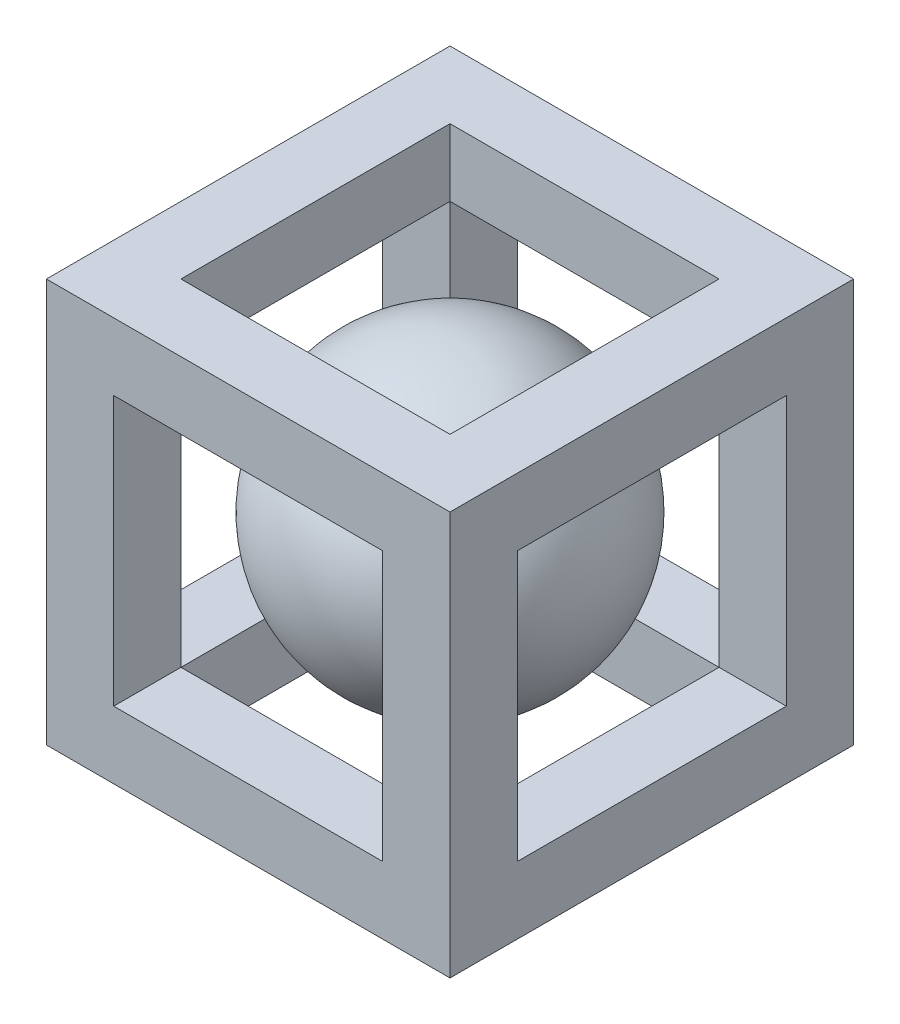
ISO-10303-21;
HEADER;
FILE_DESCRIPTION(('STEP AP214'),'2;1');
FILE_NAME('part.step','',(''),(''),'','','');
FILE_SCHEMA(('AUTOMOTIVE_DESIGN { 1 0 10303 214 1 1 1 1 }'));
ENDSEC;
DATA;
#1=APPLICATION_CONTEXT('core data for automotive mechanical design processes');
#2=APPLICATION_PROTOCOL_DEFINITION('international standard','automotive_design',2000,#1);
#3=PRODUCT_CONTEXT('',#1,'mechanical');
#4=PRODUCT('Part','Part','',(#3));
#5=PRODUCT_RELATED_PRODUCT_CATEGORY('part','',(#4));
#6=PRODUCT_DEFINITION_FORMATION('','',#4);
#7=PRODUCT_DEFINITION_CONTEXT('part definition',#1,'design');
#8=PRODUCT_DEFINITION('design','',#6,#7);
#9=PRODUCT_DEFINITION_SHAPE('','',#8);
#10=(LENGTH_UNIT() NAMED_UNIT(*) SI_UNIT(.MILLI.,.METRE.));
#11=(NAMED_UNIT(*) PLANE_ANGLE_UNIT() SI_UNIT($,.RADIAN.));
#12=(NAMED_UNIT(*) SI_UNIT($,.STERADIAN.) SOLID_ANGLE_UNIT());
#13=UNCERTAINTY_MEASURE_WITH_UNIT(LENGTH_MEASURE(1.E-05),#10,'distance_accuracy_value','');
#14=(GEOMETRIC_REPRESENTATION_CONTEXT(3) GLOBAL_UNCERTAINTY_ASSIGNED_CONTEXT((#13)) GLOBAL_UNIT_ASSIGNED_CONTEXT((#10,
#11,#12)) REPRESENTATION_CONTEXT('',''));
#15=CARTESIAN_POINT('',(0.,0.,0.));
#16=DIRECTION('',(0.,0.,1.));
#17=DIRECTION('',(1.,0.,0.));
#18=AXIS2_PLACEMENT_3D('',#15,#16,#17);
#19=CARTESIAN_POINT('',(-30.,30.,30.));
#20=DIRECTION('',(0.,1.,0.));
#21=DIRECTION('',(0.,0.,1.));
#22=AXIS2_PLACEMENT_3D('',#19,#20,#21);
#23=SPHERICAL_SURFACE('',#22,22.5);
#24=CARTESIAN_POINT('',(-30.,52.5,30.));
#25=VERTEX_POINT('',#24);
#26=VERTEX_LOOP('',#25);
#27=FACE_BOUND('',#26,.T.);
#28=ADVANCED_FACE('F49',(#27),#23,.T.);
#29=CLOSED_SHELL('',(#28));
#30=MANIFOLD_SOLID_BREP('B2',#29);
#31=CARTESIAN_POINT('',(0.,0.,60.));
#32=DIRECTION('',(-1.,0.,0.));
#33=DIRECTION('',(0.,0.,1.));
#34=AXIS2_PLACEMENT_3D('',#31,#32,#33);
#35=PLANE('',#34);
#36=DIRECTION('',(0.,1.,0.));
#37=VECTOR('',#36,1.);
#38=CARTESIAN_POINT('',(0.,0.,0.));
#39=LINE('',#38,#37);
#40=CARTESIAN_POINT('',(0.,0.,0.));
#41=VERTEX_POINT('',#40);
#42=CARTESIAN_POINT('',(0.,60.,0.));
#43=VERTEX_POINT('',#42);
#44=EDGE_CURVE('E341',#41,#43,#39,.T.);
#45=ORIENTED_EDGE('',*,*,#44,.T.);
#46=DIRECTION('',(0.,0.,-1.));
#47=VECTOR('',#46,1.);
#48=CARTESIAN_POINT('',(0.,60.,60.));
#49=LINE('',#48,#47);
#50=CARTESIAN_POINT('',(0.,60.,60.));
#51=VERTEX_POINT('',#50);
#52=EDGE_CURVE('E368',#51,#43,#49,.T.);
#53=ORIENTED_EDGE('',*,*,#52,.F.);
#54=DIRECTION('',(0.,1.,0.));
#55=VECTOR('',#54,1.);
#56=CARTESIAN_POINT('',(0.,0.,60.));
#57=LINE('',#56,#55);
#58=CARTESIAN_POINT('',(0.,0.,60.));
#59=VERTEX_POINT('',#58);
#60=EDGE_CURVE('E342',#59,#51,#57,.T.);
#61=ORIENTED_EDGE('',*,*,#60,.F.);
#62=DIRECTION('',(0.,0.,-1.));
#63=VECTOR('',#62,1.);
#64=CARTESIAN_POINT('',(0.,0.,60.));
#65=LINE('',#64,#63);
#66=EDGE_CURVE('E352',#59,#41,#65,.T.);
#67=ORIENTED_EDGE('',*,*,#66,.T.);
#68=EDGE_LOOP('',(#45,#53,#61,#67));
#69=FACE_BOUND('',#68,.T.);
#70=DIRECTION('',(0.,-1.,0.));
#71=VECTOR('',#70,1.);
#72=CARTESIAN_POINT('',(0.,0.,50.));
#73=LINE('',#72,#71);
#74=CARTESIAN_POINT('',(0.,50.,50.));
#75=VERTEX_POINT('',#74);
#76=CARTESIAN_POINT('',(0.,10.,50.));
#77=VERTEX_POINT('',#76);
#78=EDGE_CURVE('E257',#75,#77,#73,.T.);
#79=ORIENTED_EDGE('',*,*,#78,.F.);
#80=DIRECTION('',(0.,0.,1.));
#81=VECTOR('',#80,1.);
#82=CARTESIAN_POINT('',(0.,50.,60.));
#83=LINE('',#82,#81);
#84=CARTESIAN_POINT('',(0.,50.,10.));
#85=VERTEX_POINT('',#84);
#86=EDGE_CURVE('E237',#85,#75,#83,.T.);
#87=ORIENTED_EDGE('',*,*,#86,.F.);
#88=DIRECTION('',(0.,1.,0.));
#89=VECTOR('',#88,1.);
#90=CARTESIAN_POINT('',(0.,0.,9.99999999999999));
#91=LINE('',#90,#89);
#92=CARTESIAN_POINT('',(0.,10.,9.99999999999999));
#93=VERTEX_POINT('',#92);
#94=EDGE_CURVE('E252',#93,#85,#91,.T.);
#95=ORIENTED_EDGE('',*,*,#94,.F.);
#96=DIRECTION('',(0.,0.,-1.));
#97=VECTOR('',#96,1.);
#98=CARTESIAN_POINT('',(0.,10.,60.));
#99=LINE('',#98,#97);
#100=EDGE_CURVE('E244',#77,#93,#99,.T.);
#101=ORIENTED_EDGE('',*,*,#100,.F.);
#102=EDGE_LOOP('',(#79,#87,#95,#101));
#103=FACE_BOUND('',#102,.T.);
#104=ADVANCED_FACE('F64',(#69,#103),#35,.F.);
#105=CARTESIAN_POINT('',(-60.,0.,60.));
#106=DIRECTION('',(1.,0.,0.));
#107=DIRECTION('',(0.,0.,-1.));
#108=AXIS2_PLACEMENT_3D('',#105,#106,#107);
#109=PLANE('',#108);
#110=DIRECTION('',(0.,-1.,0.));
#111=VECTOR('',#110,1.);
#112=CARTESIAN_POINT('',(-60.,0.,0.));
#113=LINE('',#112,#111);
#114=CARTESIAN_POINT('',(-60.,60.,0.));
#115=VERTEX_POINT('',#114);
#116=CARTESIAN_POINT('',(-60.,0.,0.));
#117=VERTEX_POINT('',#116);
#118=EDGE_CURVE('E357',#115,#117,#113,.T.);
#119=ORIENTED_EDGE('',*,*,#118,.T.);
#120=DIRECTION('',(0.,0.,-1.));
#121=VECTOR('',#120,1.);
#122=CARTESIAN_POINT('',(-60.,0.,60.));
#123=LINE('',#122,#121);
#124=CARTESIAN_POINT('',(-60.,0.,60.));
#125=VERTEX_POINT('',#124);
#126=EDGE_CURVE('E362',#125,#117,#123,.T.);
#127=ORIENTED_EDGE('',*,*,#126,.F.);
#128=DIRECTION('',(0.,-1.,0.));
#129=VECTOR('',#128,1.);
#130=CARTESIAN_POINT('',(-60.,0.,60.));
#131=LINE('',#130,#129);
#132=CARTESIAN_POINT('',(-60.,60.,60.));
#133=VERTEX_POINT('',#132);
#134=EDGE_CURVE('E348',#133,#125,#131,.T.);
#135=ORIENTED_EDGE('',*,*,#134,.F.);
#136=DIRECTION('',(0.,0.,-1.));
#137=VECTOR('',#136,1.);
#138=CARTESIAN_POINT('',(-60.,60.,60.));
#139=LINE('',#138,#137);
#140=EDGE_CURVE('E365',#133,#115,#139,.T.);
#141=ORIENTED_EDGE('',*,*,#140,.T.);
#142=EDGE_LOOP('',(#119,#127,#135,#141));
#143=FACE_BOUND('',#142,.T.);
#144=DIRECTION('',(0.,-1.,0.));
#145=VECTOR('',#144,1.);
#146=CARTESIAN_POINT('',(-60.,50.,50.));
#147=LINE('',#146,#145);
#148=CARTESIAN_POINT('',(-60.,50.,50.));
#149=VERTEX_POINT('',#148);
#150=CARTESIAN_POINT('',(-60.,10.,50.));
#151=VERTEX_POINT('',#150);
#152=EDGE_CURVE('E86',#149,#151,#147,.T.);
#153=ORIENTED_EDGE('',*,*,#152,.T.);
#154=DIRECTION('',(0.,0.,-1.));
#155=VECTOR('',#154,1.);
#156=CARTESIAN_POINT('',(-60.,10.,50.));
#157=LINE('',#156,#155);
#158=CARTESIAN_POINT('',(-60.,10.,9.99999999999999));
#159=VERTEX_POINT('',#158);
#160=EDGE_CURVE('E208',#151,#159,#157,.T.);
#161=ORIENTED_EDGE('',*,*,#160,.T.);
#162=DIRECTION('',(0.,1.,0.));
#163=VECTOR('',#162,1.);
#164=CARTESIAN_POINT('',(-60.,50.,10.));
#165=LINE('',#164,#163);
#166=CARTESIAN_POINT('',(-60.,50.,10.));
#167=VERTEX_POINT('',#166);
#168=EDGE_CURVE('E215',#159,#167,#165,.T.);
#169=ORIENTED_EDGE('',*,*,#168,.T.);
#170=DIRECTION('',(0.,0.,1.));
#171=VECTOR('',#170,1.);
#172=CARTESIAN_POINT('',(-60.,50.,50.));
#173=LINE('',#172,#171);
#174=EDGE_CURVE('E220',#167,#149,#173,.T.);
#175=ORIENTED_EDGE('',*,*,#174,.T.);
#176=EDGE_LOOP('',(#153,#161,#169,#175));
#177=FACE_BOUND('',#176,.T.);
#178=ADVANCED_FACE('F218',(#143,#177),#109,.F.);
#179=CARTESIAN_POINT('',(-10.,10.,60.));
#180=DIRECTION('',(-1.,0.,0.));
#181=DIRECTION('',(0.,-1.,0.));
#182=AXIS2_PLACEMENT_3D('',#179,#180,#181);
#183=PLANE('',#182);
#184=DIRECTION('',(0.,0.,-1.));
#185=VECTOR('',#184,1.);
#186=CARTESIAN_POINT('',(-10.,50.,60.));
#187=LINE('',#186,#185);
#188=CARTESIAN_POINT('',(-10.,50.,60.));
#189=VERTEX_POINT('',#188);
#190=CARTESIAN_POINT('',(-10.,50.,50.));
#191=VERTEX_POINT('',#190);
#192=EDGE_CURVE('E338',#189,#191,#187,.T.);
#193=ORIENTED_EDGE('',*,*,#192,.T.);
#194=DIRECTION('',(0.,-1.,0.));
#195=VECTOR('',#194,1.);
#196=CARTESIAN_POINT('',(-10.,10.,50.));
#197=LINE('',#196,#195);
#198=CARTESIAN_POINT('',(-10.,10.,50.));
#199=VERTEX_POINT('',#198);
#200=EDGE_CURVE('E254',#191,#199,#197,.T.);
#201=ORIENTED_EDGE('',*,*,#200,.T.);
#202=DIRECTION('',(0.,0.,-1.));
#203=VECTOR('',#202,1.);
#204=CARTESIAN_POINT('',(-10.,10.,60.));
#205=LINE('',#204,#203);
#206=CARTESIAN_POINT('',(-10.,10.,60.));
#207=VERTEX_POINT('',#206);
#208=EDGE_CURVE('E326',#207,#199,#205,.T.);
#209=ORIENTED_EDGE('',*,*,#208,.F.);
#210=DIRECTION('',(0.,1.,0.));
#211=VECTOR('',#210,1.);
#212=CARTESIAN_POINT('',(-10.,10.,60.));
#213=LINE('',#212,#211);
#214=EDGE_CURVE('E305',#207,#189,#213,.T.);
#215=ORIENTED_EDGE('',*,*,#214,.T.);
#216=EDGE_LOOP('',(#193,#201,#209,#215));
#217=FACE_BOUND('',#216,.T.);
#218=ADVANCED_FACE('F387',(#217),#183,.T.);
#219=DIRECTION('',(0.,1.,0.));
#220=VECTOR('',#219,1.);
#221=CARTESIAN_POINT('',(-10.,0.,50.));
#222=LINE('',#221,#220);
#223=CARTESIAN_POINT('',(-10.,0.,50.));
#224=VERTEX_POINT('',#223);
#225=EDGE_CURVE('E283',#224,#199,#222,.T.);
#226=ORIENTED_EDGE('',*,*,#225,.T.);
#227=DIRECTION('',(0.,0.,-1.));
#228=VECTOR('',#227,1.);
#229=CARTESIAN_POINT('',(-10.,10.,60.));
#230=LINE('',#229,#228);
#231=CARTESIAN_POINT('',(-10.,10.,9.99999999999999));
#232=VERTEX_POINT('',#231);
#233=EDGE_CURVE('E241',#199,#232,#230,.T.);
#234=ORIENTED_EDGE('',*,*,#233,.T.);
#235=DIRECTION('',(0.,1.,0.));
#236=VECTOR('',#235,1.);
#237=CARTESIAN_POINT('',(-10.,0.,10.));
#238=LINE('',#237,#236);
#239=CARTESIAN_POINT('',(-10.,0.,10.));
#240=VERTEX_POINT('',#239);
#241=EDGE_CURVE('E296',#240,#232,#238,.T.);
#242=ORIENTED_EDGE('',*,*,#241,.F.);
#243=DIRECTION('',(0.,0.,-1.));
#244=VECTOR('',#243,1.);
#245=CARTESIAN_POINT('',(-10.,0.,50.));
#246=LINE('',#245,#244);
#247=EDGE_CURVE('E260',#224,#240,#246,.T.);
#248=ORIENTED_EDGE('',*,*,#247,.F.);
#249=EDGE_LOOP('',(#226,#234,#242,#248));
#250=FACE_BOUND('',#249,.T.);
#251=ADVANCED_FACE('F381',(#250),#183,.T.);
#252=CARTESIAN_POINT('',(-10.,10.,0.));
#253=VERTEX_POINT('',#252);
#254=EDGE_CURVE('E315',#232,#253,#205,.T.);
#255=ORIENTED_EDGE('',*,*,#254,.F.);
#256=DIRECTION('',(0.,1.,0.));
#257=VECTOR('',#256,1.);
#258=CARTESIAN_POINT('',(-10.,10.,9.99999999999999));
#259=LINE('',#258,#257);
#260=CARTESIAN_POINT('',(-10.,50.,10.));
#261=VERTEX_POINT('',#260);
#262=EDGE_CURVE('E249',#232,#261,#259,.T.);
#263=ORIENTED_EDGE('',*,*,#262,.T.);
#264=CARTESIAN_POINT('',(-10.,50.,0.));
#265=VERTEX_POINT('',#264);
#266=EDGE_CURVE('E337',#261,#265,#187,.T.);
#267=ORIENTED_EDGE('',*,*,#266,.T.);
#268=DIRECTION('',(0.,1.,0.));
#269=VECTOR('',#268,1.);
#270=CARTESIAN_POINT('',(-10.,10.,0.));
#271=LINE('',#270,#269);
#272=EDGE_CURVE('E304',#253,#265,#271,.T.);
#273=ORIENTED_EDGE('',*,*,#272,.F.);
#274=EDGE_LOOP('',(#255,#263,#267,#273));
#275=FACE_BOUND('',#274,.T.);
#276=ADVANCED_FACE('F437',(#275),#183,.T.);
#277=CARTESIAN_POINT('',(-10.,60.,10.));
#278=VERTEX_POINT('',#277);
#279=EDGE_CURVE('E273',#261,#278,#238,.T.);
#280=ORIENTED_EDGE('',*,*,#279,.F.);
#281=DIRECTION('',(0.,0.,1.));
#282=VECTOR('',#281,1.);
#283=CARTESIAN_POINT('',(-10.,50.,60.));
#284=LINE('',#283,#282);
#285=EDGE_CURVE('E234',#261,#191,#284,.T.);
#286=ORIENTED_EDGE('',*,*,#285,.T.);
#287=CARTESIAN_POINT('',(-10.,60.,50.));
#288=VERTEX_POINT('',#287);
#289=EDGE_CURVE('E287',#191,#288,#222,.T.);
#290=ORIENTED_EDGE('',*,*,#289,.T.);
#291=DIRECTION('',(0.,0.,-1.));
#292=VECTOR('',#291,1.);
#293=CARTESIAN_POINT('',(-10.,60.,50.));
#294=LINE('',#293,#292);
#295=EDGE_CURVE('E259',#288,#278,#294,.T.);
#296=ORIENTED_EDGE('',*,*,#295,.T.);
#297=EDGE_LOOP('',(#280,#286,#290,#296));
#298=FACE_BOUND('',#297,.T.);
#299=ADVANCED_FACE('F417',(#298),#183,.T.);
#300=CARTESIAN_POINT('',(-50.,10.,60.));
#301=DIRECTION('',(1.,0.,0.));
#302=DIRECTION('',(0.,1.,0.));
#303=AXIS2_PLACEMENT_3D('',#300,#301,#302);
#304=PLANE('',#303);
#305=DIRECTION('',(0.,0.,-1.));
#306=VECTOR('',#305,1.);
#307=CARTESIAN_POINT('',(-50.,10.,60.));
#308=LINE('',#307,#306);
#309=CARTESIAN_POINT('',(-50.,10.,60.));
#310=VERTEX_POINT('',#309);
#311=CARTESIAN_POINT('',(-50.,10.,50.));
#312=VERTEX_POINT('',#311);
#313=EDGE_CURVE('E330',#310,#312,#308,.T.);
#314=ORIENTED_EDGE('',*,*,#313,.T.);
#315=DIRECTION('',(0.,1.,0.));
#316=VECTOR('',#315,1.);
#317=CARTESIAN_POINT('',(-50.,10.,50.));
#318=LINE('',#317,#316);
#319=CARTESIAN_POINT('',(-50.,50.,50.));
#320=VERTEX_POINT('',#319);
#321=EDGE_CURVE('E47',#312,#320,#318,.T.);
#322=ORIENTED_EDGE('',*,*,#321,.T.);
#323=DIRECTION('',(0.,0.,-1.));
#324=VECTOR('',#323,1.);
#325=CARTESIAN_POINT('',(-50.,50.,60.));
#326=LINE('',#325,#324);
#327=CARTESIAN_POINT('',(-50.,50.,60.));
#328=VERTEX_POINT('',#327);
#329=EDGE_CURVE('E334',#328,#320,#326,.T.);
#330=ORIENTED_EDGE('',*,*,#329,.F.);
#331=DIRECTION('',(0.,-1.,0.));
#332=VECTOR('',#331,1.);
#333=CARTESIAN_POINT('',(-50.,10.,60.));
#334=LINE('',#333,#332);
#335=EDGE_CURVE('E310',#328,#310,#334,.T.);
#336=ORIENTED_EDGE('',*,*,#335,.T.);
#337=EDGE_LOOP('',(#314,#322,#330,#336));
#338=FACE_BOUND('',#337,.T.);
#339=ADVANCED_FACE('F399',(#338),#304,.T.);
#340=DIRECTION('',(0.,1.,0.));
#341=VECTOR('',#340,1.);
#342=CARTESIAN_POINT('',(-50.,0.,10.));
#343=LINE('',#342,#341);
#344=CARTESIAN_POINT('',(-50.,0.,10.));
#345=VERTEX_POINT('',#344);
#346=CARTESIAN_POINT('',(-50.,10.,9.99999999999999));
#347=VERTEX_POINT('',#346);
#348=EDGE_CURVE('E292',#345,#347,#343,.T.);
#349=ORIENTED_EDGE('',*,*,#348,.T.);
#350=DIRECTION('',(0.,0.,1.));
#351=VECTOR('',#350,1.);
#352=CARTESIAN_POINT('',(-50.,10.,60.));
#353=LINE('',#352,#351);
#354=EDGE_CURVE('E239',#347,#312,#353,.T.);
#355=ORIENTED_EDGE('',*,*,#354,.T.);
#356=DIRECTION('',(0.,1.,0.));
#357=VECTOR('',#356,1.);
#358=CARTESIAN_POINT('',(-50.,0.,50.));
#359=LINE('',#358,#357);
#360=CARTESIAN_POINT('',(-50.,0.,50.));
#361=VERTEX_POINT('',#360);
#362=EDGE_CURVE('E288',#361,#312,#359,.T.);
#363=ORIENTED_EDGE('',*,*,#362,.F.);
#364=DIRECTION('',(0.,0.,1.));
#365=VECTOR('',#364,1.);
#366=CARTESIAN_POINT('',(-50.,0.,50.));
#367=LINE('',#366,#365);
#368=EDGE_CURVE('E267',#345,#361,#367,.T.);
#369=ORIENTED_EDGE('',*,*,#368,.F.);
#370=EDGE_LOOP('',(#349,#355,#363,#369));
#371=FACE_BOUND('',#370,.T.);
#372=ADVANCED_FACE('F504',(#371),#304,.T.);
#373=CARTESIAN_POINT('',(-50.,50.,10.));
#374=VERTEX_POINT('',#373);
#375=CARTESIAN_POINT('',(-50.,50.,0.));
#376=VERTEX_POINT('',#375);
#377=EDGE_CURVE('E333',#374,#376,#326,.T.);
#378=ORIENTED_EDGE('',*,*,#377,.F.);
#379=DIRECTION('',(0.,-1.,0.));
#380=VECTOR('',#379,1.);
#381=CARTESIAN_POINT('',(-50.,10.,9.99999999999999));
#382=LINE('',#381,#380);
#383=EDGE_CURVE('E246',#374,#347,#382,.T.);
#384=ORIENTED_EDGE('',*,*,#383,.T.);
#385=CARTESIAN_POINT('',(-50.,10.,0.));
#386=VERTEX_POINT('',#385);
#387=EDGE_CURVE('E329',#347,#386,#308,.T.);
#388=ORIENTED_EDGE('',*,*,#387,.T.);
#389=DIRECTION('',(0.,-1.,0.));
#390=VECTOR('',#389,1.);
#391=CARTESIAN_POINT('',(-50.,10.,0.));
#392=LINE('',#391,#390);
#393=EDGE_CURVE('E321',#376,#386,#392,.T.);
#394=ORIENTED_EDGE('',*,*,#393,.F.);
#395=EDGE_LOOP('',(#378,#384,#388,#394));
#396=FACE_BOUND('',#395,.T.);
#397=ADVANCED_FACE('F428',(#396),#304,.T.);
#398=CARTESIAN_POINT('',(-50.,60.,50.));
#399=VERTEX_POINT('',#398);
#400=EDGE_CURVE('E291',#320,#399,#359,.T.);
#401=ORIENTED_EDGE('',*,*,#400,.F.);
#402=DIRECTION('',(0.,0.,-1.));
#403=VECTOR('',#402,1.);
#404=CARTESIAN_POINT('',(-50.,50.,60.));
#405=LINE('',#404,#403);
#406=EDGE_CURVE('E231',#320,#374,#405,.T.);
#407=ORIENTED_EDGE('',*,*,#406,.T.);
#408=CARTESIAN_POINT('',(-50.,60.,10.));
#409=VERTEX_POINT('',#408);
#410=EDGE_CURVE('E295',#374,#409,#343,.T.);
#411=ORIENTED_EDGE('',*,*,#410,.T.);
#412=DIRECTION('',(0.,0.,1.));
#413=VECTOR('',#412,1.);
#414=CARTESIAN_POINT('',(-50.,60.,50.));
#415=LINE('',#414,#413);
#416=EDGE_CURVE('E278',#409,#399,#415,.T.);
#417=ORIENTED_EDGE('',*,*,#416,.T.);
#418=EDGE_LOOP('',(#401,#407,#411,#417));
#419=FACE_BOUND('',#418,.T.);
#420=ADVANCED_FACE('F405',(#419),#304,.T.);
#421=CARTESIAN_POINT('',(-10.,50.,60.));
#422=DIRECTION('',(0.,-1.,0.));
#423=DIRECTION('',(0.,0.,-1.));
#424=AXIS2_PLACEMENT_3D('',#421,#422,#423);
#425=PLANE('',#424);
#426=DIRECTION('',(-1.,0.,0.));
#427=VECTOR('',#426,1.);
#428=CARTESIAN_POINT('',(-10.,50.,50.));
#429=LINE('',#428,#427);
#430=EDGE_CURVE('E301',#191,#320,#429,.T.);
#431=ORIENTED_EDGE('',*,*,#430,.F.);
#432=ORIENTED_EDGE('',*,*,#192,.F.);
#433=DIRECTION('',(-1.,0.,0.));
#434=VECTOR('',#433,1.);
#435=CARTESIAN_POINT('',(-10.,50.,60.));
#436=LINE('',#435,#434);
#437=EDGE_CURVE('E307',#189,#328,#436,.T.);
#438=ORIENTED_EDGE('',*,*,#437,.T.);
#439=ORIENTED_EDGE('',*,*,#329,.T.);
#440=EDGE_LOOP('',(#431,#432,#438,#439));
#441=FACE_BOUND('',#440,.T.);
#442=ADVANCED_FACE('F397',(#441),#425,.T.);
#443=CARTESIAN_POINT('',(-10.,10.,60.));
#444=DIRECTION('',(0.,1.,0.));
#445=DIRECTION('',(-1.,0.,0.));
#446=AXIS2_PLACEMENT_3D('',#443,#444,#445);
#447=PLANE('',#446);
#448=DIRECTION('',(1.,0.,0.));
#449=VECTOR('',#448,1.);
#450=CARTESIAN_POINT('',(-10.,10.,50.));
#451=LINE('',#450,#449);
#452=EDGE_CURVE('E71',#312,#199,#451,.T.);
#453=ORIENTED_EDGE('',*,*,#452,.F.);
#454=ORIENTED_EDGE('',*,*,#313,.F.);
#455=DIRECTION('',(1.,0.,0.));
#456=VECTOR('',#455,1.);
#457=CARTESIAN_POINT('',(-10.,10.,60.));
#458=LINE('',#457,#456);
#459=EDGE_CURVE('E313',#310,#207,#458,.T.);
#460=ORIENTED_EDGE('',*,*,#459,.T.);
#461=ORIENTED_EDGE('',*,*,#208,.T.);
#462=EDGE_LOOP('',(#453,#454,#460,#461));
#463=FACE_BOUND('',#462,.T.);
#464=ADVANCED_FACE('F383',(#463),#447,.T.);
#465=CARTESIAN_POINT('',(0.,0.,60.));
#466=DIRECTION('',(0.,0.,1.));
#467=DIRECTION('',(1.,0.,0.));
#468=AXIS2_PLACEMENT_3D('',#465,#466,#467);
#469=PLANE('',#468);
#470=ORIENTED_EDGE('',*,*,#60,.T.);
#471=DIRECTION('',(-1.,0.,0.));
#472=VECTOR('',#471,1.);
#473=CARTESIAN_POINT('',(0.,60.,60.));
#474=LINE('',#473,#472);
#475=EDGE_CURVE('E345',#51,#133,#474,.T.);
#476=ORIENTED_EDGE('',*,*,#475,.T.);
#477=ORIENTED_EDGE('',*,*,#134,.T.);
#478=DIRECTION('',(1.,0.,0.));
#479=VECTOR('',#478,1.);
#480=CARTESIAN_POINT('',(0.,0.,60.));
#481=LINE('',#480,#479);
#482=EDGE_CURVE('E350',#125,#59,#481,.T.);
#483=ORIENTED_EDGE('',*,*,#482,.T.);
#484=EDGE_LOOP('',(#470,#476,#477,#483));
#485=FACE_BOUND('',#484,.T.);
#486=ORIENTED_EDGE('',*,*,#437,.F.);
#487=ORIENTED_EDGE('',*,*,#214,.F.);
#488=ORIENTED_EDGE('',*,*,#459,.F.);
#489=ORIENTED_EDGE('',*,*,#335,.F.);
#490=EDGE_LOOP('',(#486,#487,#488,#489));
#491=FACE_BOUND('',#490,.T.);
#492=ADVANCED_FACE('F392',(#485,#491),#469,.T.);
#493=CARTESIAN_POINT('',(0.,0.,0.));
#494=DIRECTION('',(0.,0.,1.));
#495=DIRECTION('',(1.,0.,0.));
#496=AXIS2_PLACEMENT_3D('',#493,#494,#495);
#497=PLANE('',#496);
#498=ORIENTED_EDGE('',*,*,#44,.F.);
#499=DIRECTION('',(1.,0.,0.));
#500=VECTOR('',#499,1.);
#501=CARTESIAN_POINT('',(0.,0.,0.));
#502=LINE('',#501,#500);
#503=EDGE_CURVE('E346',#117,#41,#502,.T.);
#504=ORIENTED_EDGE('',*,*,#503,.F.);
#505=ORIENTED_EDGE('',*,*,#118,.F.);
#506=DIRECTION('',(-1.,0.,0.));
#507=VECTOR('',#506,1.);
#508=CARTESIAN_POINT('',(0.,60.,0.));
#509=LINE('',#508,#507);
#510=EDGE_CURVE('E355',#43,#115,#509,.T.);
#511=ORIENTED_EDGE('',*,*,#510,.F.);
#512=EDGE_LOOP('',(#498,#504,#505,#511));
#513=FACE_BOUND('',#512,.T.);
#514=ORIENTED_EDGE('',*,*,#272,.T.);
#515=DIRECTION('',(-1.,0.,0.));
#516=VECTOR('',#515,1.);
#517=CARTESIAN_POINT('',(-10.,50.,0.));
#518=LINE('',#517,#516);
#519=EDGE_CURVE('E318',#265,#376,#518,.T.);
#520=ORIENTED_EDGE('',*,*,#519,.T.);
#521=ORIENTED_EDGE('',*,*,#393,.T.);
#522=DIRECTION('',(1.,0.,0.));
#523=VECTOR('',#522,1.);
#524=CARTESIAN_POINT('',(-10.,10.,0.));
#525=LINE('',#524,#523);
#526=EDGE_CURVE('E308',#386,#253,#525,.T.);
#527=ORIENTED_EDGE('',*,*,#526,.T.);
#528=EDGE_LOOP('',(#514,#520,#521,#527));
#529=FACE_BOUND('',#528,.T.);
#530=ADVANCED_FACE('F433',(#513,#529),#497,.F.);
#531=CARTESIAN_POINT('',(0.,60.,60.));
#532=DIRECTION('',(0.,-1.,0.));
#533=DIRECTION('',(1.,0.,0.));
#534=AXIS2_PLACEMENT_3D('',#531,#532,#533);
#535=PLANE('',#534);
#536=DIRECTION('',(-1.,0.,0.));
#537=VECTOR('',#536,1.);
#538=CARTESIAN_POINT('',(-10.,60.,10.));
#539=LINE('',#538,#537);
#540=EDGE_CURVE('E275',#278,#409,#539,.T.);
#541=ORIENTED_EDGE('',*,*,#540,.F.);
#542=ORIENTED_EDGE('',*,*,#295,.F.);
#543=DIRECTION('',(1.,0.,0.));
#544=VECTOR('',#543,1.);
#545=CARTESIAN_POINT('',(-10.,60.,50.));
#546=LINE('',#545,#544);
#547=EDGE_CURVE('E264',#399,#288,#546,.T.);
#548=ORIENTED_EDGE('',*,*,#547,.F.);
#549=ORIENTED_EDGE('',*,*,#416,.F.);
#550=EDGE_LOOP('',(#541,#542,#548,#549));
#551=FACE_BOUND('',#550,.T.);
#552=ORIENTED_EDGE('',*,*,#510,.T.);
#553=ORIENTED_EDGE('',*,*,#140,.F.);
#554=ORIENTED_EDGE('',*,*,#475,.F.);
#555=ORIENTED_EDGE('',*,*,#52,.T.);
#556=EDGE_LOOP('',(#552,#553,#554,#555));
#557=FACE_BOUND('',#556,.T.);
#558=ADVANCED_FACE('F412',(#551,#557),#535,.F.);
#559=CARTESIAN_POINT('',(0.,0.,60.));
#560=DIRECTION('',(0.,1.,0.));
#561=DIRECTION('',(-1.,0.,0.));
#562=AXIS2_PLACEMENT_3D('',#559,#560,#561);
#563=PLANE('',#562);
#564=DIRECTION('',(1.,0.,0.));
#565=VECTOR('',#564,1.);
#566=CARTESIAN_POINT('',(-10.,0.,50.));
#567=LINE('',#566,#565);
#568=EDGE_CURVE('E270',#361,#224,#567,.T.);
#569=ORIENTED_EDGE('',*,*,#568,.T.);
#570=ORIENTED_EDGE('',*,*,#247,.T.);
#571=DIRECTION('',(-1.,0.,0.));
#572=VECTOR('',#571,1.);
#573=CARTESIAN_POINT('',(-10.,0.,10.));
#574=LINE('',#573,#572);
#575=EDGE_CURVE('E263',#240,#345,#574,.T.);
#576=ORIENTED_EDGE('',*,*,#575,.T.);
#577=ORIENTED_EDGE('',*,*,#368,.T.);
#578=EDGE_LOOP('',(#569,#570,#576,#577));
#579=FACE_BOUND('',#578,.T.);
#580=ORIENTED_EDGE('',*,*,#503,.T.);
#581=ORIENTED_EDGE('',*,*,#66,.F.);
#582=ORIENTED_EDGE('',*,*,#482,.F.);
#583=ORIENTED_EDGE('',*,*,#126,.T.);
#584=EDGE_LOOP('',(#580,#581,#582,#583));
#585=FACE_BOUND('',#584,.T.);
#586=ADVANCED_FACE('F485',(#579,#585),#563,.F.);
#587=DIRECTION('',(1.,0.,0.));
#588=VECTOR('',#587,1.);
#589=CARTESIAN_POINT('',(-10.,50.,9.99999999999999));
#590=LINE('',#589,#588);
#591=EDGE_CURVE('E286',#374,#261,#590,.T.);
#592=ORIENTED_EDGE('',*,*,#591,.F.);
#593=ORIENTED_EDGE('',*,*,#377,.T.);
#594=ORIENTED_EDGE('',*,*,#519,.F.);
#595=ORIENTED_EDGE('',*,*,#266,.F.);
#596=EDGE_LOOP('',(#592,#593,#594,#595));
#597=FACE_BOUND('',#596,.T.);
#598=ADVANCED_FACE('F424',(#597),#425,.T.);
#599=DIRECTION('',(-1.,0.,0.));
#600=VECTOR('',#599,1.);
#601=CARTESIAN_POINT('',(-10.,10.,9.99999999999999));
#602=LINE('',#601,#600);
#603=EDGE_CURVE('E371',#232,#347,#602,.T.);
#604=ORIENTED_EDGE('',*,*,#603,.F.);
#605=ORIENTED_EDGE('',*,*,#254,.T.);
#606=ORIENTED_EDGE('',*,*,#526,.F.);
#607=ORIENTED_EDGE('',*,*,#387,.F.);
#608=EDGE_LOOP('',(#604,#605,#606,#607));
#609=FACE_BOUND('',#608,.T.);
#610=ADVANCED_FACE('F493',(#609),#447,.T.);
#611=CARTESIAN_POINT('',(-10.,0.,10.));
#612=DIRECTION('',(0.,0.,-1.));
#613=DIRECTION('',(-1.,0.,0.));
#614=AXIS2_PLACEMENT_3D('',#611,#612,#613);
#615=PLANE('',#614);
#616=ORIENTED_EDGE('',*,*,#603,.T.);
#617=ORIENTED_EDGE('',*,*,#348,.F.);
#618=ORIENTED_EDGE('',*,*,#575,.F.);
#619=ORIENTED_EDGE('',*,*,#241,.T.);
#620=EDGE_LOOP('',(#616,#617,#618,#619));
#621=FACE_BOUND('',#620,.T.);
#622=ADVANCED_FACE('F507',(#621),#615,.F.);
#623=CARTESIAN_POINT('',(-10.,0.,50.));
#624=DIRECTION('',(0.,0.,1.));
#625=DIRECTION('',(1.,0.,0.));
#626=AXIS2_PLACEMENT_3D('',#623,#624,#625);
#627=PLANE('',#626);
#628=ORIENTED_EDGE('',*,*,#452,.T.);
#629=ORIENTED_EDGE('',*,*,#225,.F.);
#630=ORIENTED_EDGE('',*,*,#568,.F.);
#631=ORIENTED_EDGE('',*,*,#362,.T.);
#632=EDGE_LOOP('',(#628,#629,#630,#631));
#633=FACE_BOUND('',#632,.T.);
#634=ADVANCED_FACE('F376',(#633),#627,.F.);
#635=ORIENTED_EDGE('',*,*,#430,.T.);
#636=ORIENTED_EDGE('',*,*,#400,.T.);
#637=ORIENTED_EDGE('',*,*,#547,.T.);
#638=ORIENTED_EDGE('',*,*,#289,.F.);
#639=EDGE_LOOP('',(#635,#636,#637,#638));
#640=FACE_BOUND('',#639,.T.);
#641=ADVANCED_FACE('F403',(#640),#627,.F.);
#642=ORIENTED_EDGE('',*,*,#591,.T.);
#643=ORIENTED_EDGE('',*,*,#279,.T.);
#644=ORIENTED_EDGE('',*,*,#540,.T.);
#645=ORIENTED_EDGE('',*,*,#410,.F.);
#646=EDGE_LOOP('',(#642,#643,#644,#645));
#647=FACE_BOUND('',#646,.T.);
#648=ADVANCED_FACE('F420',(#647),#615,.F.);
#649=CARTESIAN_POINT('',(30.,50.,50.));
#650=DIRECTION('',(0.,-1.,0.));
#651=DIRECTION('',(1.,0.,0.));
#652=AXIS2_PLACEMENT_3D('',#649,#650,#651);
#653=PLANE('',#652);
#654=DIRECTION('',(-1.,0.,0.));
#655=VECTOR('',#654,1.);
#656=CARTESIAN_POINT('',(30.,50.,50.));
#657=LINE('',#656,#655);
#658=EDGE_CURVE('E225',#320,#149,#657,.T.);
#659=ORIENTED_EDGE('',*,*,#658,.T.);
#660=ORIENTED_EDGE('',*,*,#174,.F.);
#661=DIRECTION('',(-1.,0.,0.));
#662=VECTOR('',#661,1.);
#663=CARTESIAN_POINT('',(30.,50.,10.));
#664=LINE('',#663,#662);
#665=EDGE_CURVE('E228',#374,#167,#664,.T.);
#666=ORIENTED_EDGE('',*,*,#665,.F.);
#667=ORIENTED_EDGE('',*,*,#406,.F.);
#668=EDGE_LOOP('',(#659,#660,#666,#667));
#669=FACE_BOUND('',#668,.T.);
#670=ADVANCED_FACE('F518',(#669),#653,.T.);
#671=CARTESIAN_POINT('',(30.,50.,10.));
#672=DIRECTION('',(0.,0.,1.));
#673=DIRECTION('',(0.,-1.,0.));
#674=AXIS2_PLACEMENT_3D('',#671,#672,#673);
#675=PLANE('',#674);
#676=ORIENTED_EDGE('',*,*,#665,.T.);
#677=ORIENTED_EDGE('',*,*,#168,.F.);
#678=DIRECTION('',(-1.,0.,0.));
#679=VECTOR('',#678,1.);
#680=CARTESIAN_POINT('',(30.,10.,9.99999999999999));
#681=LINE('',#680,#679);
#682=EDGE_CURVE('E211',#347,#159,#681,.T.);
#683=ORIENTED_EDGE('',*,*,#682,.F.);
#684=ORIENTED_EDGE('',*,*,#383,.F.);
#685=EDGE_LOOP('',(#676,#677,#683,#684));
#686=FACE_BOUND('',#685,.T.);
#687=ADVANCED_FACE('F462',(#686),#675,.T.);
#688=CARTESIAN_POINT('',(30.,10.,50.));
#689=DIRECTION('',(0.,1.,0.));
#690=DIRECTION('',(-1.,0.,0.));
#691=AXIS2_PLACEMENT_3D('',#688,#689,#690);
#692=PLANE('',#691);
#693=ORIENTED_EDGE('',*,*,#682,.T.);
#694=ORIENTED_EDGE('',*,*,#160,.F.);
#695=DIRECTION('',(-1.,0.,0.));
#696=VECTOR('',#695,1.);
#697=CARTESIAN_POINT('',(30.,10.,50.));
#698=LINE('',#697,#696);
#699=EDGE_CURVE('E199',#312,#151,#698,.T.);
#700=ORIENTED_EDGE('',*,*,#699,.F.);
#701=ORIENTED_EDGE('',*,*,#354,.F.);
#702=EDGE_LOOP('',(#693,#694,#700,#701));
#703=FACE_BOUND('',#702,.T.);
#704=ADVANCED_FACE('F209',(#703),#692,.T.);
#705=CARTESIAN_POINT('',(30.,50.,50.));
#706=DIRECTION('',(0.,0.,-1.));
#707=DIRECTION('',(0.,1.,0.));
#708=AXIS2_PLACEMENT_3D('',#705,#706,#707);
#709=PLANE('',#708);
#710=ORIENTED_EDGE('',*,*,#699,.T.);
#711=ORIENTED_EDGE('',*,*,#152,.F.);
#712=ORIENTED_EDGE('',*,*,#658,.F.);
#713=ORIENTED_EDGE('',*,*,#321,.F.);
#714=EDGE_LOOP('',(#710,#711,#712,#713));
#715=FACE_BOUND('',#714,.T.);
#716=ADVANCED_FACE('F201',(#715),#709,.T.);
#717=ORIENTED_EDGE('',*,*,#78,.T.);
#718=EDGE_CURVE('E204',#77,#199,#698,.T.);
#719=ORIENTED_EDGE('',*,*,#718,.T.);
#720=ORIENTED_EDGE('',*,*,#200,.F.);
#721=EDGE_CURVE('E227',#75,#191,#657,.T.);
#722=ORIENTED_EDGE('',*,*,#721,.F.);
#723=EDGE_LOOP('',(#717,#719,#720,#722));
#724=FACE_BOUND('',#723,.T.);
#725=ADVANCED_FACE('F454',(#724),#709,.T.);
#726=ORIENTED_EDGE('',*,*,#94,.T.);
#727=EDGE_CURVE('E78',#85,#261,#664,.T.);
#728=ORIENTED_EDGE('',*,*,#727,.T.);
#729=ORIENTED_EDGE('',*,*,#262,.F.);
#730=EDGE_CURVE('E205',#93,#232,#681,.T.);
#731=ORIENTED_EDGE('',*,*,#730,.F.);
#732=EDGE_LOOP('',(#726,#728,#729,#731));
#733=FACE_BOUND('',#732,.T.);
#734=ADVANCED_FACE('F441',(#733),#675,.T.);
#735=ORIENTED_EDGE('',*,*,#100,.T.);
#736=ORIENTED_EDGE('',*,*,#730,.T.);
#737=ORIENTED_EDGE('',*,*,#233,.F.);
#738=ORIENTED_EDGE('',*,*,#718,.F.);
#739=EDGE_LOOP('',(#735,#736,#737,#738));
#740=FACE_BOUND('',#739,.T.);
#741=ADVANCED_FACE('F444',(#740),#692,.T.);
#742=ORIENTED_EDGE('',*,*,#86,.T.);
#743=ORIENTED_EDGE('',*,*,#721,.T.);
#744=ORIENTED_EDGE('',*,*,#285,.F.);
#745=ORIENTED_EDGE('',*,*,#727,.F.);
#746=EDGE_LOOP('',(#742,#743,#744,#745));
#747=FACE_BOUND('',#746,.T.);
#748=ADVANCED_FACE('F452',(#747),#653,.T.);
#749=CLOSED_SHELL('',(#104,#178,#218,#251,#276,#299,#339,#372,#397,#420,#442,#464,#492,#530,
#558,#586,#598,#610,#622,#634,#641,#648,#670,#687,#704,#716,#725,#734,#741,#748));
#750=MANIFOLD_SOLID_BREP('B6',#749);
#751=ADVANCED_BREP_SHAPE_REPRESENTATION('',(#18,#30,#750),#14);
#752=SHAPE_DEFINITION_REPRESENTATION(#9,#751);
ENDSEC;
END-ISO-10303-21;
